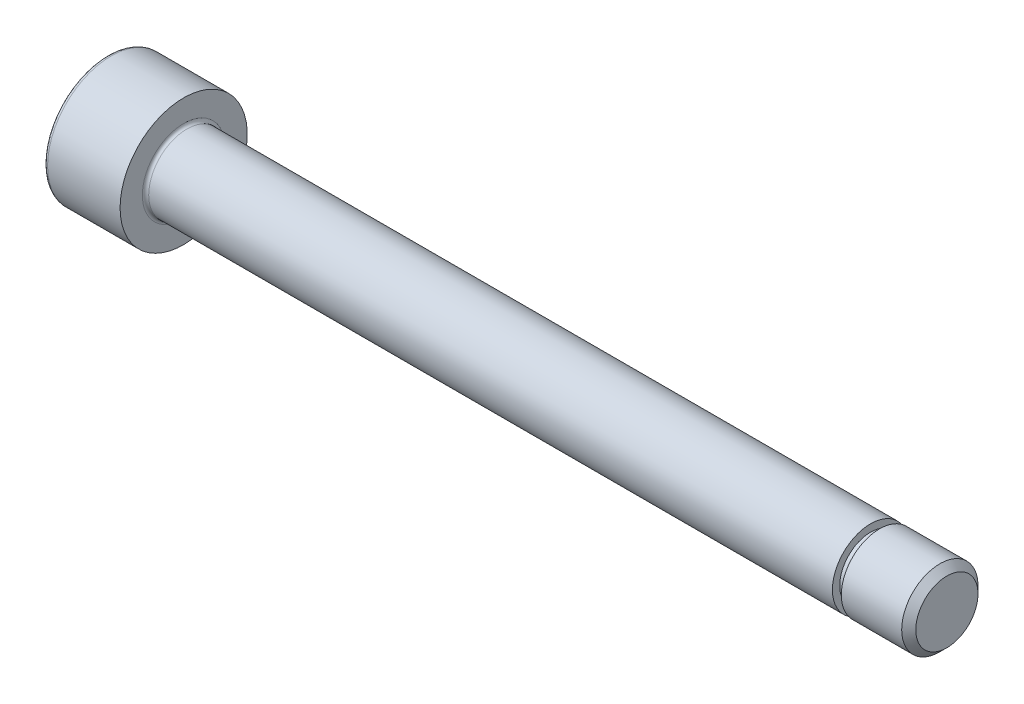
ISO-10303-21;
HEADER;
FILE_DESCRIPTION(('STEP AP214'),'2;1');
FILE_NAME('part.step','',(''),(''),'','','');
FILE_SCHEMA(('AUTOMOTIVE_DESIGN { 1 0 10303 214 1 1 1 1 }'));
ENDSEC;
DATA;
#1=APPLICATION_CONTEXT('core data for automotive mechanical design processes');
#2=APPLICATION_PROTOCOL_DEFINITION('international standard','automotive_design',2000,#1);
#3=PRODUCT_CONTEXT('',#1,'mechanical');
#4=PRODUCT('Part','Part','',(#3));
#5=PRODUCT_RELATED_PRODUCT_CATEGORY('part','',(#4));
#6=PRODUCT_DEFINITION_FORMATION('','',#4);
#7=PRODUCT_DEFINITION_CONTEXT('part definition',#1,'design');
#8=PRODUCT_DEFINITION('design','',#6,#7);
#9=PRODUCT_DEFINITION_SHAPE('','',#8);
#10=(LENGTH_UNIT() NAMED_UNIT(*) SI_UNIT(.MILLI.,.METRE.));
#11=(NAMED_UNIT(*) PLANE_ANGLE_UNIT() SI_UNIT($,.RADIAN.));
#12=(NAMED_UNIT(*) SI_UNIT($,.STERADIAN.) SOLID_ANGLE_UNIT());
#13=UNCERTAINTY_MEASURE_WITH_UNIT(LENGTH_MEASURE(1.E-05),#10,'distance_accuracy_value','');
#14=(GEOMETRIC_REPRESENTATION_CONTEXT(3) GLOBAL_UNCERTAINTY_ASSIGNED_CONTEXT((#13)) GLOBAL_UNIT_ASSIGNED_CONTEXT((#10,
#11,#12)) REPRESENTATION_CONTEXT('',''));
#15=CARTESIAN_POINT('',(0.,0.,0.));
#16=DIRECTION('',(0.,0.,1.));
#17=DIRECTION('',(1.,0.,0.));
#18=AXIS2_PLACEMENT_3D('',#15,#16,#17);
#19=CARTESIAN_POINT('',(-31.75,0.,0.));
#20=DIRECTION('',(-1.,0.,0.));
#21=DIRECTION('',(0.,0.,1.));
#22=AXIS2_PLACEMENT_3D('',#19,#20,#21);
#23=CYLINDRICAL_SURFACE('',#22,3.);
#24=CARTESIAN_POINT('',(60.,0.,0.));
#25=DIRECTION('',(-1.,0.,0.));
#26=DIRECTION('',(0.,0.,1.));
#27=AXIS2_PLACEMENT_3D('',#24,#25,#26);
#28=CIRCLE('',#27,3.);
#29=CARTESIAN_POINT('',(60.,0.,3.));
#30=VERTEX_POINT('',#29);
#31=EDGE_CURVE('E31',#30,#30,#28,.F.);
#32=ORIENTED_EDGE('',*,*,#31,.F.);
#33=EDGE_LOOP('',(#32));
#34=FACE_BOUND('',#33,.T.);
#35=CARTESIAN_POINT('',(6.25,0.,0.));
#36=DIRECTION('',(1.,0.,0.));
#37=DIRECTION('',(0.,0.,-1.));
#38=AXIS2_PLACEMENT_3D('',#35,#36,#37);
#39=CIRCLE('',#38,3.);
#40=CARTESIAN_POINT('',(6.25,0.,-3.));
#41=VERTEX_POINT('',#40);
#42=EDGE_CURVE('E187',#41,#41,#39,.T.);
#43=ORIENTED_EDGE('',*,*,#42,.T.);
#44=EDGE_LOOP('',(#43));
#45=FACE_BOUND('',#44,.T.);
#46=ADVANCED_FACE('F27',(#34,#45),#23,.T.);
#47=CARTESIAN_POINT('',(0.,0.,0.));
#48=DIRECTION('',(-1.,0.,0.));
#49=DIRECTION('',(0.,0.,1.));
#50=AXIS2_PLACEMENT_3D('',#47,#48,#49);
#51=PLANE('',#50);
#52=DIRECTION('',(0.,-0.499999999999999,0.866025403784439));
#53=VECTOR('',#52,1.);
#54=CARTESIAN_POINT('',(0.,2.93524876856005,0.));
#55=LINE('',#54,#53);
#56=CARTESIAN_POINT('',(0.,2.93524876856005,0.));
#57=VERTEX_POINT('',#56);
#58=CARTESIAN_POINT('',(0.,1.46762438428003,2.542));
#59=VERTEX_POINT('',#58);
#60=EDGE_CURVE('E113',#57,#59,#55,.T.);
#61=ORIENTED_EDGE('',*,*,#60,.T.);
#62=DIRECTION('',(0.,1.,0.));
#63=VECTOR('',#62,1.);
#64=CARTESIAN_POINT('',(0.,-1.46762438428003,2.542));
#65=LINE('',#64,#63);
#66=CARTESIAN_POINT('',(0.,-1.46762438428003,2.542));
#67=VERTEX_POINT('',#66);
#68=EDGE_CURVE('E102',#67,#59,#65,.T.);
#69=ORIENTED_EDGE('',*,*,#68,.F.);
#70=DIRECTION('',(0.,-0.500000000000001,-0.866025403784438));
#71=VECTOR('',#70,1.);
#72=CARTESIAN_POINT('',(0.,-1.46762438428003,2.542));
#73=LINE('',#72,#71);
#74=CARTESIAN_POINT('',(0.,-2.93524876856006,0.));
#75=VERTEX_POINT('',#74);
#76=EDGE_CURVE('E112',#67,#75,#73,.T.);
#77=ORIENTED_EDGE('',*,*,#76,.T.);
#78=DIRECTION('',(0.,0.499999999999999,-0.866025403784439));
#79=VECTOR('',#78,1.);
#80=CARTESIAN_POINT('',(0.,-2.93524876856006,0.));
#81=LINE('',#80,#79);
#82=CARTESIAN_POINT('',(0.,-1.46762438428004,-2.542));
#83=VERTEX_POINT('',#82);
#84=EDGE_CURVE('E132',#75,#83,#81,.T.);
#85=ORIENTED_EDGE('',*,*,#84,.T.);
#86=DIRECTION('',(0.,-1.,0.));
#87=VECTOR('',#86,1.);
#88=CARTESIAN_POINT('',(0.,1.46762438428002,-2.542));
#89=LINE('',#88,#87);
#90=CARTESIAN_POINT('',(0.,1.46762438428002,-2.542));
#91=VERTEX_POINT('',#90);
#92=EDGE_CURVE('E135',#91,#83,#89,.T.);
#93=ORIENTED_EDGE('',*,*,#92,.F.);
#94=DIRECTION('',(0.,-0.500000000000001,-0.866025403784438));
#95=VECTOR('',#94,1.);
#96=CARTESIAN_POINT('',(0.,2.93524876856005,0.));
#97=LINE('',#96,#95);
#98=EDGE_CURVE('E122',#57,#91,#97,.T.);
#99=ORIENTED_EDGE('',*,*,#98,.F.);
#100=EDGE_LOOP('',(#61,#69,#77,#85,#93,#99));
#101=FACE_BOUND('',#100,.T.);
#102=CARTESIAN_POINT('',(0.,0.,0.));
#103=DIRECTION('',(-1.,0.,0.));
#104=DIRECTION('',(0.,0.,1.));
#105=AXIS2_PLACEMENT_3D('',#102,#103,#104);
#106=CIRCLE('',#105,4.7);
#107=CARTESIAN_POINT('',(0.,0.,4.7));
#108=VERTEX_POINT('',#107);
#109=EDGE_CURVE('E36',#108,#108,#106,.T.);
#110=ORIENTED_EDGE('',*,*,#109,.T.);
#111=EDGE_LOOP('',(#110));
#112=FACE_BOUND('',#111,.T.);
#113=ADVANCED_FACE('F29',(#101,#112),#51,.T.);
#114=CARTESIAN_POINT('',(-31.75,0.,0.));
#115=DIRECTION('',(-1.,0.,0.));
#116=DIRECTION('',(0.,0.,1.));
#117=AXIS2_PLACEMENT_3D('',#114,#115,#116);
#118=CYLINDRICAL_SURFACE('',#117,5.);
#119=CARTESIAN_POINT('',(0.300000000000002,0.,0.));
#120=DIRECTION('',(-1.,0.,0.));
#121=DIRECTION('',(0.,0.,1.));
#122=AXIS2_PLACEMENT_3D('',#119,#120,#121);
#123=CIRCLE('',#122,5.);
#124=CARTESIAN_POINT('',(0.300000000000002,0.,5.));
#125=VERTEX_POINT('',#124);
#126=EDGE_CURVE('E11',#125,#125,#123,.F.);
#127=ORIENTED_EDGE('',*,*,#126,.T.);
#128=EDGE_LOOP('',(#127));
#129=FACE_BOUND('',#128,.T.);
#130=CARTESIAN_POINT('',(6.,0.,0.));
#131=DIRECTION('',(-1.,0.,0.));
#132=DIRECTION('',(0.,0.,1.));
#133=AXIS2_PLACEMENT_3D('',#130,#131,#132);
#134=CIRCLE('',#133,5.);
#135=CARTESIAN_POINT('',(6.,0.,5.));
#136=VERTEX_POINT('',#135);
#137=EDGE_CURVE('E181',#136,#136,#134,.T.);
#138=ORIENTED_EDGE('',*,*,#137,.T.);
#139=EDGE_LOOP('',(#138));
#140=FACE_BOUND('',#139,.T.);
#141=ADVANCED_FACE('F224',(#129,#140),#118,.T.);
#142=CARTESIAN_POINT('',(6.,5.,0.));
#143=DIRECTION('',(1.,0.,0.));
#144=DIRECTION('',(0.,0.,-1.));
#145=AXIS2_PLACEMENT_3D('',#142,#143,#144);
#146=PLANE('',#145);
#147=CARTESIAN_POINT('',(6.,0.,0.));
#148=DIRECTION('',(1.,0.,0.));
#149=DIRECTION('',(0.,0.,-1.));
#150=AXIS2_PLACEMENT_3D('',#147,#148,#149);
#151=CIRCLE('',#150,3.25);
#152=CARTESIAN_POINT('',(6.,0.,-3.25));
#153=VERTEX_POINT('',#152);
#154=EDGE_CURVE('E184',#153,#153,#151,.F.);
#155=ORIENTED_EDGE('',*,*,#154,.T.);
#156=EDGE_LOOP('',(#155));
#157=FACE_BOUND('',#156,.T.);
#158=ORIENTED_EDGE('',*,*,#137,.F.);
#159=EDGE_LOOP('',(#158));
#160=FACE_BOUND('',#159,.T.);
#161=ADVANCED_FACE('F251',(#157,#160),#146,.T.);
#162=CARTESIAN_POINT('',(6.25,0.,0.));
#163=DIRECTION('',(1.,0.,0.));
#164=DIRECTION('',(0.,0.,-1.));
#165=AXIS2_PLACEMENT_3D('',#162,#163,#164);
#166=TOROIDAL_SURFACE('',#165,3.25,0.25);
#167=ORIENTED_EDGE('',*,*,#42,.F.);
#168=EDGE_LOOP('',(#167));
#169=FACE_BOUND('',#168,.T.);
#170=ORIENTED_EDGE('',*,*,#154,.F.);
#171=EDGE_LOOP('',(#170));
#172=FACE_BOUND('',#171,.T.);
#173=ADVANCED_FACE('F247',(#169,#172),#166,.F.);
#174=CARTESIAN_POINT('',(0.300000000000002,0.,0.));
#175=DIRECTION('',(-1.,0.,0.));
#176=DIRECTION('',(0.,0.,1.));
#177=AXIS2_PLACEMENT_3D('',#174,#175,#176);
#178=TOROIDAL_SURFACE('',#177,4.7,0.3);
#179=ORIENTED_EDGE('',*,*,#126,.F.);
#180=EDGE_LOOP('',(#179));
#181=FACE_BOUND('',#180,.T.);
#182=ORIENTED_EDGE('',*,*,#109,.F.);
#183=EDGE_LOOP('',(#182));
#184=FACE_BOUND('',#183,.T.);
#185=ADVANCED_FACE('F250',(#181,#184),#178,.T.);
#186=CARTESIAN_POINT('',(3.,2.93524876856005,0.));
#187=DIRECTION('',(0.,-0.866025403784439,-0.499999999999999));
#188=DIRECTION('',(0.,0.499999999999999,-0.866025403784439));
#189=AXIS2_PLACEMENT_3D('',#186,#187,#188);
#190=PLANE('',#189);
#191=ORIENTED_EDGE('',*,*,#60,.F.);
#192=DIRECTION('',(-1.,0.,0.));
#193=VECTOR('',#192,1.);
#194=CARTESIAN_POINT('',(3.,2.93524876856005,0.));
#195=LINE('',#194,#193);
#196=CARTESIAN_POINT('',(3.,2.93524876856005,0.));
#197=VERTEX_POINT('',#196);
#198=EDGE_CURVE('E159',#197,#57,#195,.T.);
#199=ORIENTED_EDGE('',*,*,#198,.F.);
#200=DIRECTION('',(0.,-0.499999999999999,0.866025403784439));
#201=VECTOR('',#200,1.);
#202=CARTESIAN_POINT('',(3.,2.93524876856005,0.));
#203=LINE('',#202,#201);
#204=CARTESIAN_POINT('',(3.,2.20143657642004,1.271));
#205=VERTEX_POINT('',#204);
#206=EDGE_CURVE('E44',#197,#205,#203,.T.);
#207=ORIENTED_EDGE('',*,*,#206,.T.);
#208=CARTESIAN_POINT('',(3.,1.46762438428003,2.542));
#209=VERTEX_POINT('',#208);
#210=EDGE_CURVE('E117',#205,#209,#203,.T.);
#211=ORIENTED_EDGE('',*,*,#210,.T.);
#212=DIRECTION('',(-1.,0.,0.));
#213=VECTOR('',#212,1.);
#214=CARTESIAN_POINT('',(3.,1.46762438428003,2.542));
#215=LINE('',#214,#213);
#216=EDGE_CURVE('E106',#209,#59,#215,.T.);
#217=ORIENTED_EDGE('',*,*,#216,.T.);
#218=EDGE_LOOP('',(#191,#199,#207,#211,#217));
#219=FACE_BOUND('',#218,.T.);
#220=ADVANCED_FACE('F115',(#219),#190,.T.);
#221=CARTESIAN_POINT('',(3.,-1.46762438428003,2.542));
#222=DIRECTION('',(0.,0.,1.));
#223=DIRECTION('',(0.,-1.,0.));
#224=AXIS2_PLACEMENT_3D('',#221,#222,#223);
#225=PLANE('',#224);
#226=ORIENTED_EDGE('',*,*,#68,.T.);
#227=ORIENTED_EDGE('',*,*,#216,.F.);
#228=DIRECTION('',(0.,1.,0.));
#229=VECTOR('',#228,1.);
#230=CARTESIAN_POINT('',(3.,-1.46762438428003,2.542));
#231=LINE('',#230,#229);
#232=CARTESIAN_POINT('',(3.,0.,2.542));
#233=VERTEX_POINT('',#232);
#234=EDGE_CURVE('E139',#233,#209,#231,.T.);
#235=ORIENTED_EDGE('',*,*,#234,.F.);
#236=CARTESIAN_POINT('',(3.,-1.46762438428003,2.542));
#237=VERTEX_POINT('',#236);
#238=EDGE_CURVE('E140',#237,#233,#231,.T.);
#239=ORIENTED_EDGE('',*,*,#238,.F.);
#240=DIRECTION('',(-1.,0.,0.));
#241=VECTOR('',#240,1.);
#242=CARTESIAN_POINT('',(3.,-1.46762438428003,2.542));
#243=LINE('',#242,#241);
#244=EDGE_CURVE('E108',#237,#67,#243,.T.);
#245=ORIENTED_EDGE('',*,*,#244,.T.);
#246=EDGE_LOOP('',(#226,#227,#235,#239,#245));
#247=FACE_BOUND('',#246,.T.);
#248=ADVANCED_FACE('F104',(#247),#225,.F.);
#249=CARTESIAN_POINT('',(3.,-1.46762438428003,2.542));
#250=DIRECTION('',(0.,0.866025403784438,-0.500000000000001));
#251=DIRECTION('',(0.,0.500000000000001,0.866025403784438));
#252=AXIS2_PLACEMENT_3D('',#249,#250,#251);
#253=PLANE('',#252);
#254=ORIENTED_EDGE('',*,*,#76,.F.);
#255=ORIENTED_EDGE('',*,*,#244,.F.);
#256=DIRECTION('',(0.,-0.500000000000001,-0.866025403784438));
#257=VECTOR('',#256,1.);
#258=CARTESIAN_POINT('',(3.,-1.46762438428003,2.542));
#259=LINE('',#258,#257);
#260=CARTESIAN_POINT('',(3.,-2.20143657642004,1.271));
#261=VERTEX_POINT('',#260);
#262=EDGE_CURVE('E144',#237,#261,#259,.T.);
#263=ORIENTED_EDGE('',*,*,#262,.T.);
#264=CARTESIAN_POINT('',(3.,-2.93524876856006,0.));
#265=VERTEX_POINT('',#264);
#266=EDGE_CURVE('E143',#261,#265,#259,.T.);
#267=ORIENTED_EDGE('',*,*,#266,.T.);
#268=DIRECTION('',(-1.,0.,0.));
#269=VECTOR('',#268,1.);
#270=CARTESIAN_POINT('',(3.,-2.93524876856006,0.));
#271=LINE('',#270,#269);
#272=EDGE_CURVE('E167',#265,#75,#271,.T.);
#273=ORIENTED_EDGE('',*,*,#272,.T.);
#274=EDGE_LOOP('',(#254,#255,#263,#267,#273));
#275=FACE_BOUND('',#274,.T.);
#276=ADVANCED_FACE('F262',(#275),#253,.T.);
#277=CARTESIAN_POINT('',(3.,-2.93524876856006,0.));
#278=DIRECTION('',(0.,0.866025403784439,0.499999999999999));
#279=DIRECTION('',(0.,-0.499999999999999,0.866025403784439));
#280=AXIS2_PLACEMENT_3D('',#277,#278,#279);
#281=PLANE('',#280);
#282=ORIENTED_EDGE('',*,*,#84,.F.);
#283=ORIENTED_EDGE('',*,*,#272,.F.);
#284=DIRECTION('',(0.,0.499999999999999,-0.866025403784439));
#285=VECTOR('',#284,1.);
#286=CARTESIAN_POINT('',(3.,-2.93524876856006,0.));
#287=LINE('',#286,#285);
#288=CARTESIAN_POINT('',(3.,-2.20143657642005,-1.271));
#289=VERTEX_POINT('',#288);
#290=EDGE_CURVE('E148',#265,#289,#287,.T.);
#291=ORIENTED_EDGE('',*,*,#290,.T.);
#292=CARTESIAN_POINT('',(3.,-1.46762438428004,-2.542));
#293=VERTEX_POINT('',#292);
#294=EDGE_CURVE('E147',#289,#293,#287,.T.);
#295=ORIENTED_EDGE('',*,*,#294,.T.);
#296=DIRECTION('',(-1.,0.,0.));
#297=VECTOR('',#296,1.);
#298=CARTESIAN_POINT('',(3.,-1.46762438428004,-2.542));
#299=LINE('',#298,#297);
#300=EDGE_CURVE('E164',#293,#83,#299,.T.);
#301=ORIENTED_EDGE('',*,*,#300,.T.);
#302=EDGE_LOOP('',(#282,#283,#291,#295,#301));
#303=FACE_BOUND('',#302,.T.);
#304=ADVANCED_FACE('F265',(#303),#281,.T.);
#305=CARTESIAN_POINT('',(3.,1.46762438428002,-2.542));
#306=DIRECTION('',(0.,0.,-1.));
#307=DIRECTION('',(0.,1.,0.));
#308=AXIS2_PLACEMENT_3D('',#305,#306,#307);
#309=PLANE('',#308);
#310=ORIENTED_EDGE('',*,*,#92,.T.);
#311=ORIENTED_EDGE('',*,*,#300,.F.);
#312=DIRECTION('',(0.,-1.,0.));
#313=VECTOR('',#312,1.);
#314=CARTESIAN_POINT('',(3.,1.46762438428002,-2.542));
#315=LINE('',#314,#313);
#316=CARTESIAN_POINT('',(3.,0.,-2.542));
#317=VERTEX_POINT('',#316);
#318=EDGE_CURVE('E151',#317,#293,#315,.T.);
#319=ORIENTED_EDGE('',*,*,#318,.F.);
#320=CARTESIAN_POINT('',(3.,1.46762438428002,-2.542));
#321=VERTEX_POINT('',#320);
#322=EDGE_CURVE('E152',#321,#317,#315,.T.);
#323=ORIENTED_EDGE('',*,*,#322,.F.);
#324=DIRECTION('',(-1.,0.,0.));
#325=VECTOR('',#324,1.);
#326=CARTESIAN_POINT('',(3.,1.46762438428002,-2.542));
#327=LINE('',#326,#325);
#328=EDGE_CURVE('E161',#321,#91,#327,.T.);
#329=ORIENTED_EDGE('',*,*,#328,.T.);
#330=EDGE_LOOP('',(#310,#311,#319,#323,#329));
#331=FACE_BOUND('',#330,.T.);
#332=ADVANCED_FACE('F269',(#331),#309,.F.);
#333=CARTESIAN_POINT('',(3.,2.93524876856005,0.));
#334=DIRECTION('',(0.,0.866025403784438,-0.500000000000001));
#335=DIRECTION('',(0.,0.500000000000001,0.866025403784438));
#336=AXIS2_PLACEMENT_3D('',#333,#334,#335);
#337=PLANE('',#336);
#338=ORIENTED_EDGE('',*,*,#98,.T.);
#339=ORIENTED_EDGE('',*,*,#328,.F.);
#340=DIRECTION('',(0.,-0.500000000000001,-0.866025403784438));
#341=VECTOR('',#340,1.);
#342=CARTESIAN_POINT('',(3.,2.93524876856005,0.));
#343=LINE('',#342,#341);
#344=CARTESIAN_POINT('',(3.,2.20143657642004,-1.271));
#345=VERTEX_POINT('',#344);
#346=EDGE_CURVE('E155',#345,#321,#343,.T.);
#347=ORIENTED_EDGE('',*,*,#346,.F.);
#348=EDGE_CURVE('E156',#197,#345,#343,.T.);
#349=ORIENTED_EDGE('',*,*,#348,.F.);
#350=ORIENTED_EDGE('',*,*,#198,.T.);
#351=EDGE_LOOP('',(#338,#339,#347,#349,#350));
#352=FACE_BOUND('',#351,.T.);
#353=ADVANCED_FACE('F273',(#352),#337,.F.);
#354=CARTESIAN_POINT('',(3.,1.46762438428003,2.542));
#355=DIRECTION('',(-1.,0.,0.));
#356=DIRECTION('',(0.,0.,1.));
#357=AXIS2_PLACEMENT_3D('',#354,#355,#356);
#358=PLANE('',#357);
#359=CARTESIAN_POINT('',(3.,0.,0.));
#360=DIRECTION('',(-1.,0.,0.));
#361=DIRECTION('',(0.,0.,1.));
#362=AXIS2_PLACEMENT_3D('',#359,#360,#361);
#363=CIRCLE('',#362,2.542);
#364=EDGE_CURVE('E118',#261,#233,#363,.T.);
#365=ORIENTED_EDGE('',*,*,#364,.F.);
#366=ORIENTED_EDGE('',*,*,#262,.F.);
#367=ORIENTED_EDGE('',*,*,#238,.T.);
#368=EDGE_LOOP('',(#365,#366,#367));
#369=FACE_BOUND('',#368,.T.);
#370=ADVANCED_FACE('F277',(#369),#358,.T.);
#371=EDGE_CURVE('E303',#289,#261,#363,.T.);
#372=ORIENTED_EDGE('',*,*,#371,.F.);
#373=ORIENTED_EDGE('',*,*,#290,.F.);
#374=ORIENTED_EDGE('',*,*,#266,.F.);
#375=EDGE_LOOP('',(#372,#373,#374));
#376=FACE_BOUND('',#375,.T.);
#377=ADVANCED_FACE('F280',(#376),#358,.T.);
#378=EDGE_CURVE('E304',#317,#289,#363,.T.);
#379=ORIENTED_EDGE('',*,*,#378,.F.);
#380=ORIENTED_EDGE('',*,*,#318,.T.);
#381=ORIENTED_EDGE('',*,*,#294,.F.);
#382=EDGE_LOOP('',(#379,#380,#381));
#383=FACE_BOUND('',#382,.T.);
#384=ADVANCED_FACE('F285',(#383),#358,.T.);
#385=EDGE_CURVE('E305',#345,#317,#363,.T.);
#386=ORIENTED_EDGE('',*,*,#385,.F.);
#387=ORIENTED_EDGE('',*,*,#346,.T.);
#388=ORIENTED_EDGE('',*,*,#322,.T.);
#389=EDGE_LOOP('',(#386,#387,#388));
#390=FACE_BOUND('',#389,.T.);
#391=ADVANCED_FACE('F293',(#390),#358,.T.);
#392=EDGE_CURVE('E175',#205,#345,#363,.T.);
#393=ORIENTED_EDGE('',*,*,#392,.F.);
#394=ORIENTED_EDGE('',*,*,#206,.F.);
#395=ORIENTED_EDGE('',*,*,#348,.T.);
#396=EDGE_LOOP('',(#393,#394,#395));
#397=FACE_BOUND('',#396,.T.);
#398=ADVANCED_FACE('F288',(#397),#358,.T.);
#399=EDGE_CURVE('E171',#233,#205,#363,.T.);
#400=ORIENTED_EDGE('',*,*,#399,.F.);
#401=ORIENTED_EDGE('',*,*,#234,.T.);
#402=ORIENTED_EDGE('',*,*,#210,.F.);
#403=EDGE_LOOP('',(#400,#401,#402));
#404=FACE_BOUND('',#403,.T.);
#405=ADVANCED_FACE('F257',(#404),#358,.T.);
#406=CARTESIAN_POINT('',(3.,0.,0.));
#407=DIRECTION('',(-1.,0.,0.));
#408=DIRECTION('',(0.,0.,1.));
#409=AXIS2_PLACEMENT_3D('',#406,#407,#408);
#410=CONICAL_SURFACE('',#409,2.542,1.04719755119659);
#411=CARTESIAN_POINT('',(4.46762438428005,0.,0.));
#412=VERTEX_POINT('',#411);
#413=VERTEX_LOOP('',#412);
#414=FACE_BOUND('',#413,.T.);
#415=ORIENTED_EDGE('',*,*,#399,.T.);
#416=ORIENTED_EDGE('',*,*,#392,.T.);
#417=ORIENTED_EDGE('',*,*,#385,.T.);
#418=ORIENTED_EDGE('',*,*,#378,.T.);
#419=ORIENTED_EDGE('',*,*,#371,.T.);
#420=ORIENTED_EDGE('',*,*,#364,.T.);
#421=EDGE_LOOP('',(#415,#416,#417,#418,#419,#420));
#422=FACE_BOUND('',#421,.T.);
#423=ADVANCED_FACE('F213',(#414,#422),#410,.F.);
#424=CARTESIAN_POINT('',(60.,5.95595595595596,0.));
#425=DIRECTION('',(-1.,0.,0.));
#426=DIRECTION('',(0.,0.,1.));
#427=AXIS2_PLACEMENT_3D('',#424,#425,#426);
#428=PLANE('',#427);
#429=ORIENTED_EDGE('',*,*,#31,.T.);
#430=EDGE_LOOP('',(#429));
#431=FACE_BOUND('',#430,.T.);
#432=CARTESIAN_POINT('',(60.,0.,0.));
#433=DIRECTION('',(1.,0.,0.));
#434=DIRECTION('',(0.,0.,-1.));
#435=AXIS2_PLACEMENT_3D('',#432,#433,#434);
#436=CIRCLE('',#435,2.425);
#437=CARTESIAN_POINT('',(60.,0.,-2.425));
#438=VERTEX_POINT('',#437);
#439=EDGE_CURVE('E128',#438,#438,#436,.T.);
#440=ORIENTED_EDGE('',*,*,#439,.F.);
#441=EDGE_LOOP('',(#440));
#442=FACE_BOUND('',#441,.T.);
#443=ADVANCED_FACE('F205',(#431,#442),#428,.F.);
#444=CARTESIAN_POINT('',(66.3671509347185,0.,0.));
#445=DIRECTION('',(1.,0.,0.));
#446=DIRECTION('',(0.,0.,-1.));
#447=AXIS2_PLACEMENT_3D('',#444,#445,#446);
#448=CYLINDRICAL_SURFACE('',#447,2.425);
#449=CARTESIAN_POINT('',(60.7,0.,0.));
#450=DIRECTION('',(1.,0.,0.));
#451=DIRECTION('',(0.,0.,-1.));
#452=AXIS2_PLACEMENT_3D('',#449,#450,#451);
#453=CIRCLE('',#452,2.425);
#454=CARTESIAN_POINT('',(60.7,0.,-2.425));
#455=VERTEX_POINT('',#454);
#456=EDGE_CURVE('E195',#455,#455,#453,.T.);
#457=ORIENTED_EDGE('',*,*,#456,.F.);
#458=EDGE_LOOP('',(#457));
#459=FACE_BOUND('',#458,.T.);
#460=ORIENTED_EDGE('',*,*,#439,.T.);
#461=EDGE_LOOP('',(#460));
#462=FACE_BOUND('',#461,.T.);
#463=ADVANCED_FACE('F203',(#459,#462),#448,.T.);
#464=CARTESIAN_POINT('',(60.7,5.95595595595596,0.));
#465=DIRECTION('',(1.,0.,0.));
#466=DIRECTION('',(0.,0.,-1.));
#467=AXIS2_PLACEMENT_3D('',#464,#465,#466);
#468=PLANE('',#467);
#469=CARTESIAN_POINT('',(60.7,0.,0.));
#470=DIRECTION('',(1.,0.,0.));
#471=DIRECTION('',(0.,0.,-1.));
#472=AXIS2_PLACEMENT_3D('',#469,#470,#471);
#473=CIRCLE('',#472,3.);
#474=CARTESIAN_POINT('',(60.7,0.,-3.));
#475=VERTEX_POINT('',#474);
#476=EDGE_CURVE('E126',#475,#475,#473,.F.);
#477=ORIENTED_EDGE('',*,*,#476,.T.);
#478=EDGE_LOOP('',(#477));
#479=FACE_BOUND('',#478,.T.);
#480=ORIENTED_EDGE('',*,*,#456,.T.);
#481=EDGE_LOOP('',(#480));
#482=FACE_BOUND('',#481,.T.);
#483=ADVANCED_FACE('F201',(#479,#482),#468,.F.);
#484=CARTESIAN_POINT('',(66.,2.4455,0.));
#485=DIRECTION('',(1.,0.,0.));
#486=DIRECTION('',(0.,0.,-1.));
#487=AXIS2_PLACEMENT_3D('',#484,#485,#486);
#488=PLANE('',#487);
#489=CARTESIAN_POINT('',(66.,0.,0.));
#490=DIRECTION('',(-1.,0.,0.));
#491=DIRECTION('',(0.,0.,1.));
#492=AXIS2_PLACEMENT_3D('',#489,#490,#491);
#493=CIRCLE('',#492,2.4455);
#494=CARTESIAN_POINT('',(66.,0.,2.4455));
#495=VERTEX_POINT('',#494);
#496=EDGE_CURVE('E174',#495,#495,#493,.T.);
#497=ORIENTED_EDGE('',*,*,#496,.F.);
#498=EDGE_LOOP('',(#497));
#499=FACE_BOUND('',#498,.T.);
#500=ADVANCED_FACE('F211',(#499),#488,.T.);
#501=CARTESIAN_POINT('',(66.,0.,0.));
#502=DIRECTION('',(-1.,0.,0.));
#503=DIRECTION('',(0.,0.,1.));
#504=AXIS2_PLACEMENT_3D('',#501,#502,#503);
#505=CONICAL_SURFACE('',#504,2.4455,0.785398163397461);
#506=CARTESIAN_POINT('',(65.4455,0.,0.));
#507=DIRECTION('',(-1.,0.,0.));
#508=DIRECTION('',(0.,0.,1.));
#509=AXIS2_PLACEMENT_3D('',#506,#507,#508);
#510=CIRCLE('',#509,3.);
#511=CARTESIAN_POINT('',(65.4455,0.,3.));
#512=VERTEX_POINT('',#511);
#513=EDGE_CURVE('E178',#512,#512,#510,.T.);
#514=ORIENTED_EDGE('',*,*,#513,.F.);
#515=EDGE_LOOP('',(#514));
#516=FACE_BOUND('',#515,.T.);
#517=ORIENTED_EDGE('',*,*,#496,.T.);
#518=EDGE_LOOP('',(#517));
#519=FACE_BOUND('',#518,.T.);
#520=ADVANCED_FACE('F230',(#516,#519),#505,.T.);
#521=ORIENTED_EDGE('',*,*,#476,.F.);
#522=EDGE_LOOP('',(#521));
#523=FACE_BOUND('',#522,.T.);
#524=ORIENTED_EDGE('',*,*,#513,.T.);
#525=EDGE_LOOP('',(#524));
#526=FACE_BOUND('',#525,.T.);
#527=ADVANCED_FACE('F219',(#523,#526),#23,.T.);
#528=CLOSED_SHELL('',(#46,#113,#141,#161,#173,#185,#220,#248,#276,#304,#332,#353,#370,#377,#384,
#391,#398,#405,#423,#443,#463,#483,#500,#520,#527));
#529=MANIFOLD_SOLID_BREP('B2',#528);
#530=ADVANCED_BREP_SHAPE_REPRESENTATION('',(#18,#529),#14);
#531=SHAPE_DEFINITION_REPRESENTATION(#9,#530);
ENDSEC;
END-ISO-10303-21;
